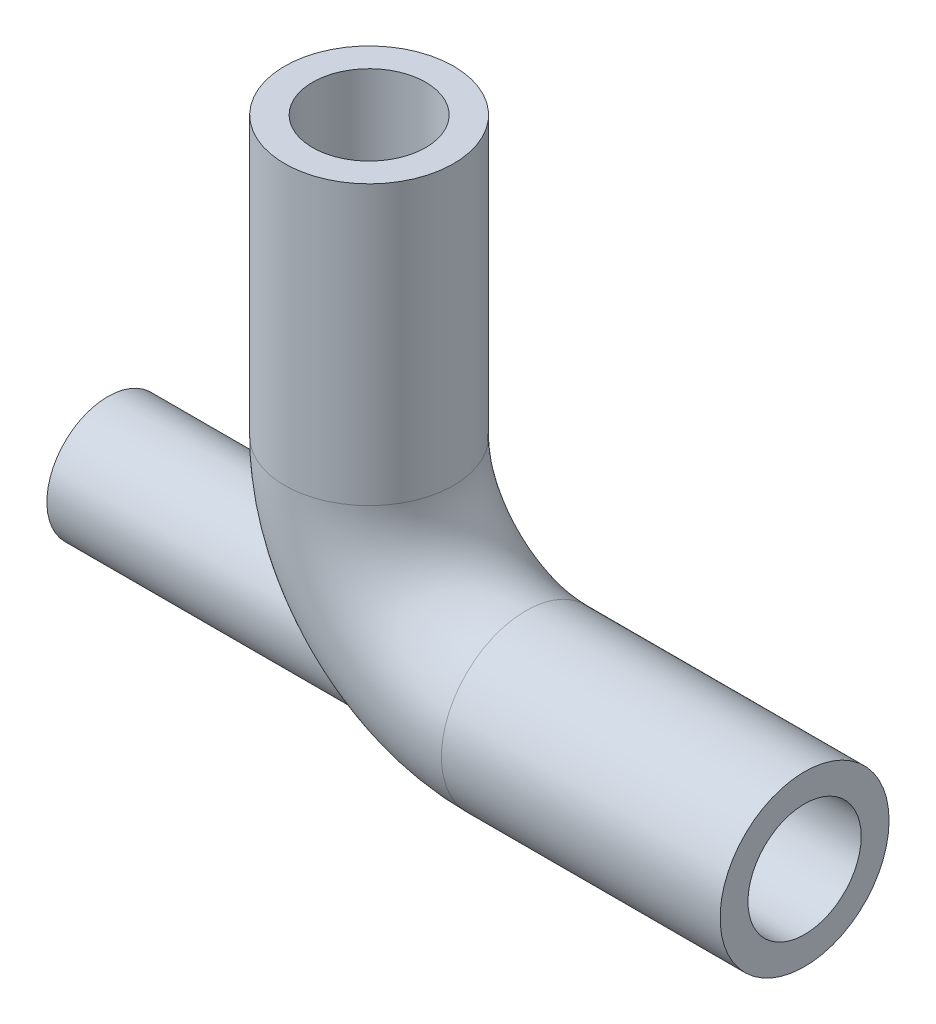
from build123d import *

# Parameters (mm, degrees)
SKETCH2_R                      = 48.5
SKETCH2_R_2                    = 32.5
BOSS_EXTRUDE1_REACH            = 435.535
BOSS_EXTRUDE1_END_MAJOR_RADIUS = 90
BOSS_EXTRUDE1_END_MINOR_RADIUS = 48.5
SKETCH7_R                      = 35
SKETCH13_R                     = 30
CUT_EXTRUDE2_DEPTH             = 434.534600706


with BuildPart() as part:
    # Sweep-Thin1: sweep along a path in Sketch1
    with BuildLine(Plane.XY) as sweep_thin1_path:
        Line((-90, 160), (-90, 0))
        ThreePointArc((-90, 0), (-63.639610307, -63.639610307), (0, -90))
        Line((0, -90), (160, -90))
    # Sketch2 → Sweep-Thin1 (sweep)
    with BuildSketch(Plane(origin=(160, -90, 0), x_dir=(0, 0, -1), z_dir=(1, 0, 0))):
        Circle(SKETCH2_R)
        Circle(SKETCH2_R_2, mode=Mode.SUBTRACT)
    sweep(path=sweep_thin1_path.line)

    # Boss-Extrude1: up to this torus (the profile starts outside it)
    boss_extrude1_end = Plane(origin=(0, 0, 0), z_dir=(0, 0, -1)) * Torus(BOSS_EXTRUDE1_END_MAJOR_RADIUS, BOSS_EXTRUDE1_END_MINOR_RADIUS, mode=Mode.PRIVATE)
    # Sketch7 → Boss-Extrude1 (add, up to the surface)
    with BuildSketch(Plane(origin=(-240, 0, 0), x_dir=(0, 0, -1), z_dir=(1, 0, 0)), mode=Mode.PRIVATE) as boss_extrude1_sk1:
        with Locations(Location((0, -90, 0), (0, 0, 4.553333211))):
            Circle(SKETCH7_R)
    boss_extrude1_tool1 = extrude(boss_extrude1_sk1.sketch, amount=BOSS_EXTRUDE1_REACH, mode=Mode.PRIVATE) - boss_extrude1_end
    add(boss_extrude1_tool1.solids().sort_by_distance((-240, -90, 0))[0])

    # Sketch13 → Cut-Extrude2 (cut, through all)
    with BuildSketch(Plane.ZY.offset(240)):
        with Locations((0, -90)):
            Circle(SKETCH13_R)
    extrude(amount=-CUT_EXTRUDE2_DEPTH, mode=Mode.SUBTRACT)


solid = part.part
